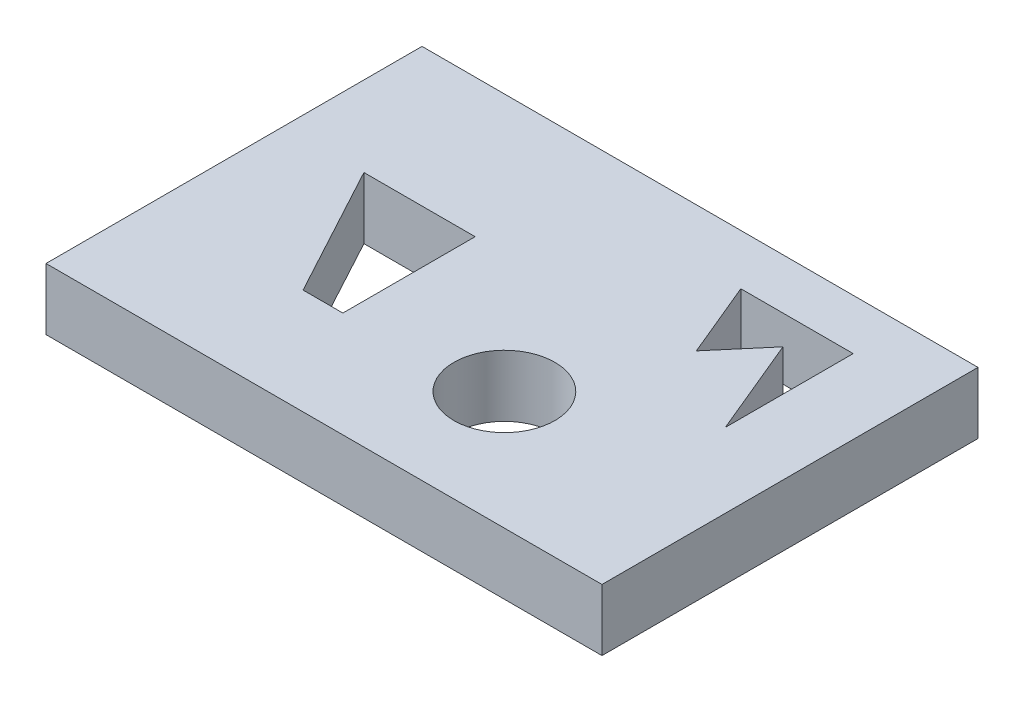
from build123d import *

# Parameters (mm, degrees)
SKETCH1_W          = 219.947915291
SKETCH1_H          = 148.755234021
EXTRUDE1_DEPTH     = 24.384
SKETCH2_R          = 19.975772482
CUT_EXTRUDE1_DEPTH = 139.77309468


with BuildPart() as part:
    # Sketch1 → Extrude1 (new body)
    with BuildSketch(Plane(origin=(0, 0, 0), x_dir=(1, 0, 0), z_dir=(0, 1, 0))):
        with Locations((4.49637987, -0.187349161)):
            Rectangle(SKETCH1_W, SKETCH1_H)
    extrude(amount=-EXTRUDE1_DEPTH)

    # Sketch2 → Cut-Extrude1 (cut, through all)
    with BuildSketch(Plane(origin=(0, 0, 0), x_dir=(-1, 0, 0), z_dir=(0, 1, 0))):
        with Locations(Location((-29.038171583, 27.738983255, 0), (0, 0, 90))):
            Circle(SKETCH2_R)
        Polygon((-85.067545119, -54.221340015), (-40.61448843, -54.221340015), (-53.116910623, -24.122916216), (-68.860701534, -42.645023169), (-85.067545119, -3.628547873), align=None)
        Polygon((29.769517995, -19.492389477), (29.769517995, 32.832562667), (45.513308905, 32.832562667), (73.75952201, -19.492389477), align=None)
    extrude(amount=-CUT_EXTRUDE1_DEPTH, mode=Mode.SUBTRACT)


solid = part.part
